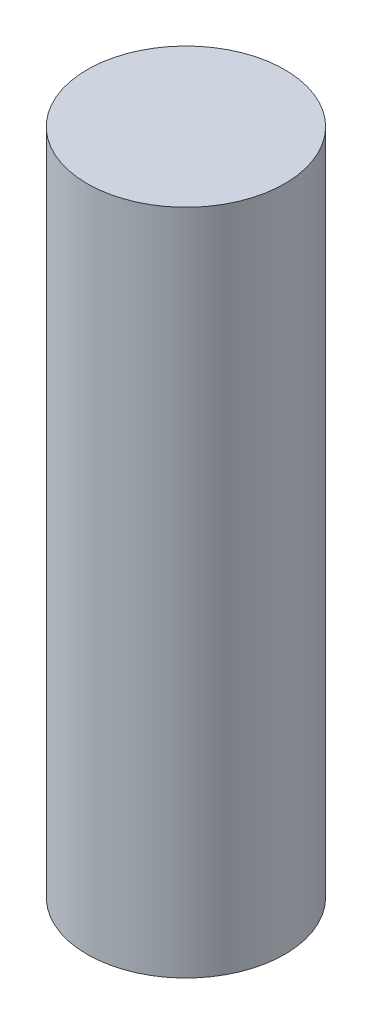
from build123d import *

# Parameters (mm, degrees)
SKETCH1_R           = 7.4
BOSS_EXTRUDE1_DEPTH = 50


with BuildPart() as part:
    # Sketch1 → Boss-Extrude1 (new body)
    with BuildSketch(Plane(origin=(0, 0, 0), x_dir=(1, 0, 0), z_dir=(0, 1, 0))):
        with Locations(Location((0, 0, 0), (0, 0, 270))):
            Circle(SKETCH1_R)
    extrude(amount=BOSS_EXTRUDE1_DEPTH)


solid = part.part
